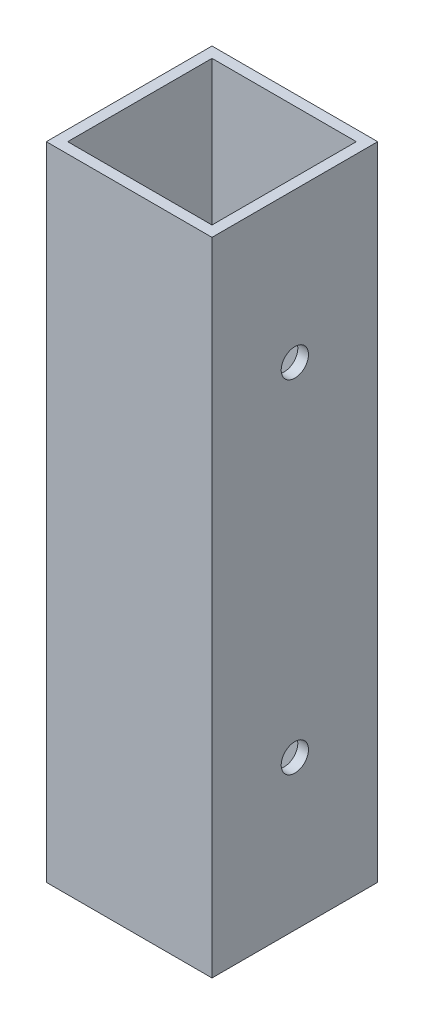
ISO-10303-21;
HEADER;
FILE_DESCRIPTION(('STEP AP214'),'2;1');
FILE_NAME('part.step','',(''),(''),'','','');
FILE_SCHEMA(('AUTOMOTIVE_DESIGN { 1 0 10303 214 1 1 1 1 }'));
ENDSEC;
DATA;
#1=APPLICATION_CONTEXT('core data for automotive mechanical design processes');
#2=APPLICATION_PROTOCOL_DEFINITION('international standard','automotive_design',2000,#1);
#3=PRODUCT_CONTEXT('',#1,'mechanical');
#4=PRODUCT('Part','Part','',(#3));
#5=PRODUCT_RELATED_PRODUCT_CATEGORY('part','',(#4));
#6=PRODUCT_DEFINITION_FORMATION('','',#4);
#7=PRODUCT_DEFINITION_CONTEXT('part definition',#1,'design');
#8=PRODUCT_DEFINITION('design','',#6,#7);
#9=PRODUCT_DEFINITION_SHAPE('','',#8);
#10=(LENGTH_UNIT() NAMED_UNIT(*) SI_UNIT(.MILLI.,.METRE.));
#11=(NAMED_UNIT(*) PLANE_ANGLE_UNIT() SI_UNIT($,.RADIAN.));
#12=(NAMED_UNIT(*) SI_UNIT($,.STERADIAN.) SOLID_ANGLE_UNIT());
#13=UNCERTAINTY_MEASURE_WITH_UNIT(LENGTH_MEASURE(1.E-05),#10,'distance_accuracy_value','');
#14=(GEOMETRIC_REPRESENTATION_CONTEXT(3) GLOBAL_UNCERTAINTY_ASSIGNED_CONTEXT((#13)) GLOBAL_UNIT_ASSIGNED_CONTEXT((#10,
#11,#12)) REPRESENTATION_CONTEXT('',''));
#15=CARTESIAN_POINT('',(0.,0.,0.));
#16=DIRECTION('',(0.,0.,1.));
#17=DIRECTION('',(1.,0.,0.));
#18=AXIS2_PLACEMENT_3D('',#15,#16,#17);
#19=CARTESIAN_POINT('',(15.5,120.,-15.5));
#20=DIRECTION('',(0.,-1.,0.));
#21=DIRECTION('',(0.,0.,-1.));
#22=AXIS2_PLACEMENT_3D('',#19,#20,#21);
#23=PLANE('',#22);
#24=DIRECTION('',(0.,0.,-1.));
#25=VECTOR('',#24,1.);
#26=CARTESIAN_POINT('',(15.5,120.,15.5));
#27=LINE('',#26,#25);
#28=CARTESIAN_POINT('',(15.5,120.,15.5));
#29=VERTEX_POINT('',#28);
#30=CARTESIAN_POINT('',(15.5,120.,-15.5));
#31=VERTEX_POINT('',#30);
#32=EDGE_CURVE('E139',#29,#31,#27,.T.);
#33=ORIENTED_EDGE('',*,*,#32,.T.);
#34=DIRECTION('',(-1.,0.,0.));
#35=VECTOR('',#34,1.);
#36=CARTESIAN_POINT('',(-15.5,120.,-15.5));
#37=LINE('',#36,#35);
#38=CARTESIAN_POINT('',(-15.5,120.,-15.5));
#39=VERTEX_POINT('',#38);
#40=EDGE_CURVE('E142',#31,#39,#37,.T.);
#41=ORIENTED_EDGE('',*,*,#40,.T.);
#42=DIRECTION('',(0.,0.,1.));
#43=VECTOR('',#42,1.);
#44=CARTESIAN_POINT('',(-15.5,120.,15.5));
#45=LINE('',#44,#43);
#46=CARTESIAN_POINT('',(-15.5,120.,15.5));
#47=VERTEX_POINT('',#46);
#48=EDGE_CURVE('E145',#39,#47,#45,.T.);
#49=ORIENTED_EDGE('',*,*,#48,.T.);
#50=DIRECTION('',(1.,0.,0.));
#51=VECTOR('',#50,1.);
#52=CARTESIAN_POINT('',(-15.5,120.,15.5));
#53=LINE('',#52,#51);
#54=EDGE_CURVE('E147',#47,#29,#53,.T.);
#55=ORIENTED_EDGE('',*,*,#54,.T.);
#56=EDGE_LOOP('',(#33,#41,#49,#55));
#57=FACE_BOUND('',#56,.T.);
#58=DIRECTION('',(0.,0.,-1.));
#59=VECTOR('',#58,1.);
#60=CARTESIAN_POINT('',(13.5,120.,13.5));
#61=LINE('',#60,#59);
#62=CARTESIAN_POINT('',(13.5,120.,13.5));
#63=VERTEX_POINT('',#62);
#64=CARTESIAN_POINT('',(13.5,120.,-13.5));
#65=VERTEX_POINT('',#64);
#66=EDGE_CURVE('E101',#63,#65,#61,.T.);
#67=ORIENTED_EDGE('',*,*,#66,.F.);
#68=DIRECTION('',(1.,0.,0.));
#69=VECTOR('',#68,1.);
#70=CARTESIAN_POINT('',(-13.5,120.,13.5));
#71=LINE('',#70,#69);
#72=CARTESIAN_POINT('',(-13.5,120.,13.5));
#73=VERTEX_POINT('',#72);
#74=EDGE_CURVE('E123',#73,#63,#71,.T.);
#75=ORIENTED_EDGE('',*,*,#74,.F.);
#76=DIRECTION('',(0.,0.,1.));
#77=VECTOR('',#76,1.);
#78=CARTESIAN_POINT('',(-13.5,120.,13.5));
#79=LINE('',#78,#77);
#80=CARTESIAN_POINT('',(-13.5,120.,-13.5));
#81=VERTEX_POINT('',#80);
#82=EDGE_CURVE('E121',#81,#73,#79,.T.);
#83=ORIENTED_EDGE('',*,*,#82,.F.);
#84=DIRECTION('',(-1.,0.,0.));
#85=VECTOR('',#84,1.);
#86=CARTESIAN_POINT('',(-13.5,120.,-13.5));
#87=LINE('',#86,#85);
#88=EDGE_CURVE('E109',#65,#81,#87,.T.);
#89=ORIENTED_EDGE('',*,*,#88,.F.);
#90=EDGE_LOOP('',(#67,#75,#83,#89));
#91=FACE_BOUND('',#90,.T.);
#92=ADVANCED_FACE('F35',(#57,#91),#23,.F.);
#93=CARTESIAN_POINT('',(15.5,0.,-15.5));
#94=DIRECTION('',(0.,-1.,0.));
#95=DIRECTION('',(0.,0.,-1.));
#96=AXIS2_PLACEMENT_3D('',#93,#94,#95);
#97=PLANE('',#96);
#98=DIRECTION('',(0.,0.,-1.));
#99=VECTOR('',#98,1.);
#100=CARTESIAN_POINT('',(15.5,0.,15.5));
#101=LINE('',#100,#99);
#102=CARTESIAN_POINT('',(15.5,0.,15.5));
#103=VERTEX_POINT('',#102);
#104=CARTESIAN_POINT('',(15.5,0.,-15.5));
#105=VERTEX_POINT('',#104);
#106=EDGE_CURVE('E117',#103,#105,#101,.T.);
#107=ORIENTED_EDGE('',*,*,#106,.F.);
#108=DIRECTION('',(1.,0.,0.));
#109=VECTOR('',#108,1.);
#110=CARTESIAN_POINT('',(-15.5,0.,15.5));
#111=LINE('',#110,#109);
#112=CARTESIAN_POINT('',(-15.5,0.,15.5));
#113=VERTEX_POINT('',#112);
#114=EDGE_CURVE('E143',#113,#103,#111,.T.);
#115=ORIENTED_EDGE('',*,*,#114,.F.);
#116=DIRECTION('',(0.,0.,1.));
#117=VECTOR('',#116,1.);
#118=CARTESIAN_POINT('',(-15.5,0.,15.5));
#119=LINE('',#118,#117);
#120=CARTESIAN_POINT('',(-15.5,0.,-15.5));
#121=VERTEX_POINT('',#120);
#122=EDGE_CURVE('E154',#121,#113,#119,.T.);
#123=ORIENTED_EDGE('',*,*,#122,.F.);
#124=DIRECTION('',(-1.,0.,0.));
#125=VECTOR('',#124,1.);
#126=CARTESIAN_POINT('',(-15.5,0.,-15.5));
#127=LINE('',#126,#125);
#128=EDGE_CURVE('E152',#105,#121,#127,.T.);
#129=ORIENTED_EDGE('',*,*,#128,.F.);
#130=EDGE_LOOP('',(#107,#115,#123,#129));
#131=FACE_BOUND('',#130,.T.);
#132=DIRECTION('',(1.,0.,0.));
#133=VECTOR('',#132,1.);
#134=CARTESIAN_POINT('',(-13.5,0.,13.5));
#135=LINE('',#134,#133);
#136=CARTESIAN_POINT('',(-13.5,0.,13.5));
#137=VERTEX_POINT('',#136);
#138=CARTESIAN_POINT('',(13.5,0.,13.5));
#139=VERTEX_POINT('',#138);
#140=EDGE_CURVE('E110',#137,#139,#135,.T.);
#141=ORIENTED_EDGE('',*,*,#140,.T.);
#142=DIRECTION('',(0.,0.,-1.));
#143=VECTOR('',#142,1.);
#144=CARTESIAN_POINT('',(13.5,0.,13.5));
#145=LINE('',#144,#143);
#146=CARTESIAN_POINT('',(13.5,0.,-13.5));
#147=VERTEX_POINT('',#146);
#148=EDGE_CURVE('E59',#139,#147,#145,.T.);
#149=ORIENTED_EDGE('',*,*,#148,.T.);
#150=DIRECTION('',(-1.,0.,0.));
#151=VECTOR('',#150,1.);
#152=CARTESIAN_POINT('',(-13.5,0.,-13.5));
#153=LINE('',#152,#151);
#154=CARTESIAN_POINT('',(-13.5,0.,-13.5));
#155=VERTEX_POINT('',#154);
#156=EDGE_CURVE('E116',#147,#155,#153,.T.);
#157=ORIENTED_EDGE('',*,*,#156,.T.);
#158=DIRECTION('',(0.,0.,1.));
#159=VECTOR('',#158,1.);
#160=CARTESIAN_POINT('',(-13.5,0.,13.5));
#161=LINE('',#160,#159);
#162=EDGE_CURVE('E131',#155,#137,#161,.T.);
#163=ORIENTED_EDGE('',*,*,#162,.T.);
#164=EDGE_LOOP('',(#141,#149,#157,#163));
#165=FACE_BOUND('',#164,.T.);
#166=ADVANCED_FACE('F173',(#131,#165),#97,.T.);
#167=CARTESIAN_POINT('',(15.5,120.,15.5));
#168=DIRECTION('',(-1.,0.,0.));
#169=DIRECTION('',(0.,0.,1.));
#170=AXIS2_PLACEMENT_3D('',#167,#168,#169);
#171=PLANE('',#170);
#172=CARTESIAN_POINT('',(15.5,92.,0.));
#173=DIRECTION('',(1.,0.,0.));
#174=DIRECTION('',(0.,0.,-1.));
#175=AXIS2_PLACEMENT_3D('',#172,#173,#174);
#176=CIRCLE('',#175,2.55269999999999);
#177=CARTESIAN_POINT('',(15.5,92.,-2.55269999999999));
#178=VERTEX_POINT('',#177);
#179=EDGE_CURVE('E219',#178,#178,#176,.T.);
#180=ORIENTED_EDGE('',*,*,#179,.F.);
#181=EDGE_LOOP('',(#180));
#182=FACE_BOUND('',#181,.T.);
#183=CARTESIAN_POINT('',(15.5,28.,0.));
#184=DIRECTION('',(1.,0.,0.));
#185=DIRECTION('',(0.,0.,-1.));
#186=AXIS2_PLACEMENT_3D('',#183,#184,#185);
#187=CIRCLE('',#186,2.55269999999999);
#188=CARTESIAN_POINT('',(15.5,28.,-2.55269999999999));
#189=VERTEX_POINT('',#188);
#190=EDGE_CURVE('E215',#189,#189,#187,.T.);
#191=ORIENTED_EDGE('',*,*,#190,.F.);
#192=EDGE_LOOP('',(#191));
#193=FACE_BOUND('',#192,.T.);
#194=ORIENTED_EDGE('',*,*,#106,.T.);
#195=DIRECTION('',(0.,-1.,0.));
#196=VECTOR('',#195,1.);
#197=CARTESIAN_POINT('',(15.5,120.,-15.5));
#198=LINE('',#197,#196);
#199=EDGE_CURVE('E11',#31,#105,#198,.T.);
#200=ORIENTED_EDGE('',*,*,#199,.F.);
#201=ORIENTED_EDGE('',*,*,#32,.F.);
#202=DIRECTION('',(0.,-1.,0.));
#203=VECTOR('',#202,1.);
#204=CARTESIAN_POINT('',(15.5,120.,15.5));
#205=LINE('',#204,#203);
#206=EDGE_CURVE('E149',#29,#103,#205,.T.);
#207=ORIENTED_EDGE('',*,*,#206,.T.);
#208=EDGE_LOOP('',(#194,#200,#201,#207));
#209=FACE_BOUND('',#208,.T.);
#210=ADVANCED_FACE('F37',(#182,#193,#209),#171,.F.);
#211=CARTESIAN_POINT('',(-15.5,120.,-15.5));
#212=DIRECTION('',(0.,0.,1.));
#213=DIRECTION('',(1.,0.,0.));
#214=AXIS2_PLACEMENT_3D('',#211,#212,#213);
#215=PLANE('',#214);
#216=ORIENTED_EDGE('',*,*,#128,.T.);
#217=DIRECTION('',(0.,-1.,0.));
#218=VECTOR('',#217,1.);
#219=CARTESIAN_POINT('',(-15.5,120.,-15.5));
#220=LINE('',#219,#218);
#221=EDGE_CURVE('E44',#39,#121,#220,.T.);
#222=ORIENTED_EDGE('',*,*,#221,.F.);
#223=ORIENTED_EDGE('',*,*,#40,.F.);
#224=ORIENTED_EDGE('',*,*,#199,.T.);
#225=EDGE_LOOP('',(#216,#222,#223,#224));
#226=FACE_BOUND('',#225,.T.);
#227=ADVANCED_FACE('F183',(#226),#215,.F.);
#228=CARTESIAN_POINT('',(-15.5,120.,15.5));
#229=DIRECTION('',(1.,0.,0.));
#230=DIRECTION('',(0.,0.,-1.));
#231=AXIS2_PLACEMENT_3D('',#228,#229,#230);
#232=PLANE('',#231);
#233=ORIENTED_EDGE('',*,*,#122,.T.);
#234=DIRECTION('',(0.,-1.,0.));
#235=VECTOR('',#234,1.);
#236=CARTESIAN_POINT('',(-15.5,120.,15.5));
#237=LINE('',#236,#235);
#238=EDGE_CURVE('E159',#47,#113,#237,.T.);
#239=ORIENTED_EDGE('',*,*,#238,.F.);
#240=ORIENTED_EDGE('',*,*,#48,.F.);
#241=ORIENTED_EDGE('',*,*,#221,.T.);
#242=EDGE_LOOP('',(#233,#239,#240,#241));
#243=FACE_BOUND('',#242,.T.);
#244=ADVANCED_FACE('F167',(#243),#232,.F.);
#245=CARTESIAN_POINT('',(-15.5,120.,15.5));
#246=DIRECTION('',(0.,0.,-1.));
#247=DIRECTION('',(-1.,0.,0.));
#248=AXIS2_PLACEMENT_3D('',#245,#246,#247);
#249=PLANE('',#248);
#250=ORIENTED_EDGE('',*,*,#114,.T.);
#251=ORIENTED_EDGE('',*,*,#206,.F.);
#252=ORIENTED_EDGE('',*,*,#54,.F.);
#253=ORIENTED_EDGE('',*,*,#238,.T.);
#254=EDGE_LOOP('',(#250,#251,#252,#253));
#255=FACE_BOUND('',#254,.T.);
#256=ADVANCED_FACE('F177',(#255),#249,.F.);
#257=CARTESIAN_POINT('',(13.5,120.,13.5));
#258=DIRECTION('',(-1.,0.,0.));
#259=DIRECTION('',(0.,0.,1.));
#260=AXIS2_PLACEMENT_3D('',#257,#258,#259);
#261=PLANE('',#260);
#262=CARTESIAN_POINT('',(13.5,92.,0.));
#263=DIRECTION('',(-1.,0.,0.));
#264=DIRECTION('',(0.,0.,1.));
#265=AXIS2_PLACEMENT_3D('',#262,#263,#264);
#266=CIRCLE('',#265,2.55269999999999);
#267=CARTESIAN_POINT('',(13.5,92.,2.55269999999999));
#268=VERTEX_POINT('',#267);
#269=EDGE_CURVE('E39',#268,#268,#266,.T.);
#270=ORIENTED_EDGE('',*,*,#269,.F.);
#271=EDGE_LOOP('',(#270));
#272=FACE_BOUND('',#271,.T.);
#273=CARTESIAN_POINT('',(13.5,28.,0.));
#274=DIRECTION('',(-1.,0.,0.));
#275=DIRECTION('',(0.,0.,1.));
#276=AXIS2_PLACEMENT_3D('',#273,#274,#275);
#277=CIRCLE('',#276,2.55269999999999);
#278=CARTESIAN_POINT('',(13.5,28.,2.55269999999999));
#279=VERTEX_POINT('',#278);
#280=EDGE_CURVE('E129',#279,#279,#277,.T.);
#281=ORIENTED_EDGE('',*,*,#280,.F.);
#282=EDGE_LOOP('',(#281));
#283=FACE_BOUND('',#282,.T.);
#284=ORIENTED_EDGE('',*,*,#148,.F.);
#285=DIRECTION('',(0.,-1.,0.));
#286=VECTOR('',#285,1.);
#287=CARTESIAN_POINT('',(13.5,120.,13.5));
#288=LINE('',#287,#286);
#289=EDGE_CURVE('E105',#63,#139,#288,.T.);
#290=ORIENTED_EDGE('',*,*,#289,.F.);
#291=ORIENTED_EDGE('',*,*,#66,.T.);
#292=DIRECTION('',(0.,-1.,0.));
#293=VECTOR('',#292,1.);
#294=CARTESIAN_POINT('',(13.5,120.,-13.5));
#295=LINE('',#294,#293);
#296=EDGE_CURVE('E104',#65,#147,#295,.T.);
#297=ORIENTED_EDGE('',*,*,#296,.T.);
#298=EDGE_LOOP('',(#284,#290,#291,#297));
#299=FACE_BOUND('',#298,.T.);
#300=ADVANCED_FACE('F103',(#272,#283,#299),#261,.T.);
#301=CARTESIAN_POINT('',(-13.5,120.,-13.5));
#302=DIRECTION('',(0.,0.,1.));
#303=DIRECTION('',(1.,0.,0.));
#304=AXIS2_PLACEMENT_3D('',#301,#302,#303);
#305=PLANE('',#304);
#306=ORIENTED_EDGE('',*,*,#156,.F.);
#307=ORIENTED_EDGE('',*,*,#296,.F.);
#308=ORIENTED_EDGE('',*,*,#88,.T.);
#309=DIRECTION('',(0.,-1.,0.));
#310=VECTOR('',#309,1.);
#311=CARTESIAN_POINT('',(-13.5,120.,-13.5));
#312=LINE('',#311,#310);
#313=EDGE_CURVE('E118',#81,#155,#312,.T.);
#314=ORIENTED_EDGE('',*,*,#313,.T.);
#315=EDGE_LOOP('',(#306,#307,#308,#314));
#316=FACE_BOUND('',#315,.T.);
#317=ADVANCED_FACE('F113',(#316),#305,.T.);
#318=CARTESIAN_POINT('',(-13.5,120.,13.5));
#319=DIRECTION('',(1.,0.,0.));
#320=DIRECTION('',(0.,0.,-1.));
#321=AXIS2_PLACEMENT_3D('',#318,#319,#320);
#322=PLANE('',#321);
#323=ORIENTED_EDGE('',*,*,#162,.F.);
#324=ORIENTED_EDGE('',*,*,#313,.F.);
#325=ORIENTED_EDGE('',*,*,#82,.T.);
#326=DIRECTION('',(0.,-1.,0.));
#327=VECTOR('',#326,1.);
#328=CARTESIAN_POINT('',(-13.5,120.,13.5));
#329=LINE('',#328,#327);
#330=EDGE_CURVE('E51',#73,#137,#329,.T.);
#331=ORIENTED_EDGE('',*,*,#330,.T.);
#332=EDGE_LOOP('',(#323,#324,#325,#331));
#333=FACE_BOUND('',#332,.T.);
#334=ADVANCED_FACE('F208',(#333),#322,.T.);
#335=CARTESIAN_POINT('',(-13.5,120.,13.5));
#336=DIRECTION('',(0.,0.,-1.));
#337=DIRECTION('',(-1.,0.,0.));
#338=AXIS2_PLACEMENT_3D('',#335,#336,#337);
#339=PLANE('',#338);
#340=ORIENTED_EDGE('',*,*,#140,.F.);
#341=ORIENTED_EDGE('',*,*,#330,.F.);
#342=ORIENTED_EDGE('',*,*,#74,.T.);
#343=ORIENTED_EDGE('',*,*,#289,.T.);
#344=EDGE_LOOP('',(#340,#341,#342,#343));
#345=FACE_BOUND('',#344,.T.);
#346=ADVANCED_FACE('F231',(#345),#339,.T.);
#347=CARTESIAN_POINT('',(15.5,28.,0.));
#348=DIRECTION('',(1.,0.,0.));
#349=DIRECTION('',(0.,0.,-1.));
#350=AXIS2_PLACEMENT_3D('',#347,#348,#349);
#351=CYLINDRICAL_SURFACE('',#350,2.55269999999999);
#352=ORIENTED_EDGE('',*,*,#280,.T.);
#353=EDGE_LOOP('',(#352));
#354=FACE_BOUND('',#353,.T.);
#355=ORIENTED_EDGE('',*,*,#190,.T.);
#356=EDGE_LOOP('',(#355));
#357=FACE_BOUND('',#356,.T.);
#358=ADVANCED_FACE('F226',(#354,#357),#351,.F.);
#359=CARTESIAN_POINT('',(15.5,92.,0.));
#360=DIRECTION('',(1.,0.,0.));
#361=DIRECTION('',(0.,0.,-1.));
#362=AXIS2_PLACEMENT_3D('',#359,#360,#361);
#363=CYLINDRICAL_SURFACE('',#362,2.55269999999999);
#364=ORIENTED_EDGE('',*,*,#269,.T.);
#365=EDGE_LOOP('',(#364));
#366=FACE_BOUND('',#365,.T.);
#367=ORIENTED_EDGE('',*,*,#179,.T.);
#368=EDGE_LOOP('',(#367));
#369=FACE_BOUND('',#368,.T.);
#370=ADVANCED_FACE('F224',(#366,#369),#363,.F.);
#371=CLOSED_SHELL('',(#92,#166,#210,#227,#244,#256,#300,#317,#334,#346,#358,#370));
#372=MANIFOLD_SOLID_BREP('B2',#371);
#373=ADVANCED_BREP_SHAPE_REPRESENTATION('',(#18,#372),#14);
#374=SHAPE_DEFINITION_REPRESENTATION(#9,#373);
ENDSEC;
END-ISO-10303-21;
